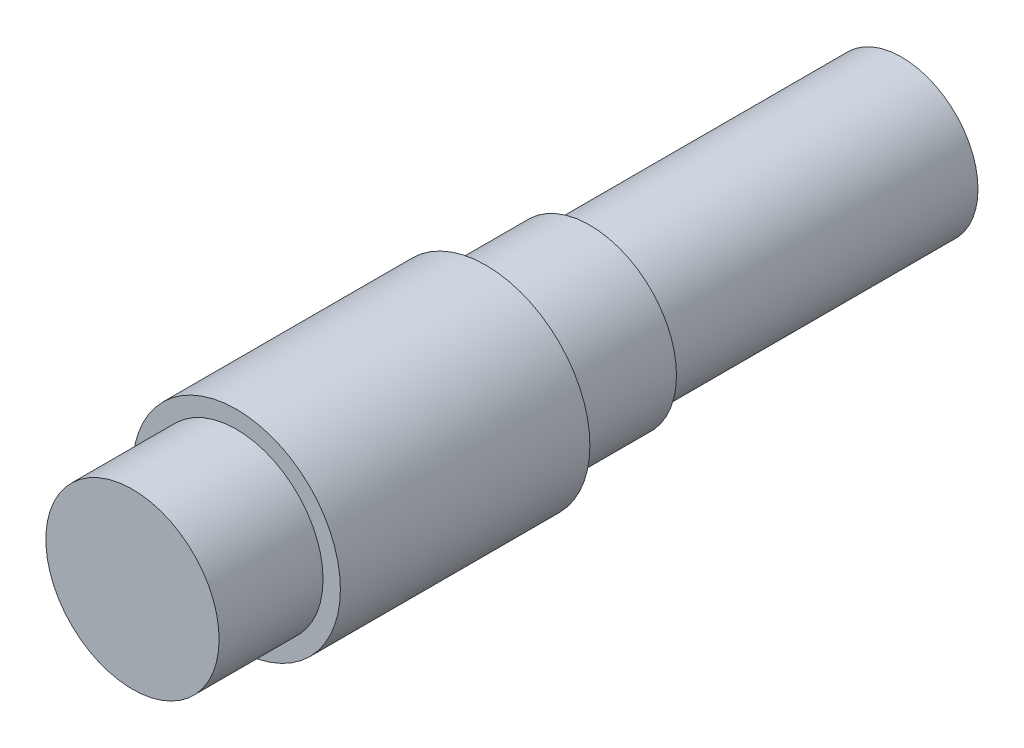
from build123d import *

# Parameters (mm, degrees)
SKIZZE1_R                       = 15
AUFSATZ_LINEAR_AUSTRAGEN1_DEPTH = 18
SKIZZE2_R                       = 12.5
AUFSATZ_LINEAR_AUSTRAGEN2_DEPTH = 33
SKIZZE3_R                       = 11
AUFSATZ_LINEAR_AUSTRAGEN3_DEPTH = 78


with BuildPart() as part:
    # Skizze1 → Aufsatz-Linear austragen1 (new, symmetric)
    with BuildSketch(Plane.XY):
        Circle(SKIZZE1_R)
    extrude(amount=AUFSATZ_LINEAR_AUSTRAGEN1_DEPTH, both=True)

    # Skizze2 → Aufsatz-Linear austragen2 (add, symmetric)
    with BuildSketch(Plane.XY):
        Circle(SKIZZE2_R)
    extrude(amount=AUFSATZ_LINEAR_AUSTRAGEN2_DEPTH, both=True)

    # Skizze3 → Aufsatz-Linear austragen3 (add)
    with BuildSketch(Plane.XY):
        Circle(SKIZZE3_R)
    extrude(amount=-AUFSATZ_LINEAR_AUSTRAGEN3_DEPTH)


solid = part.part
